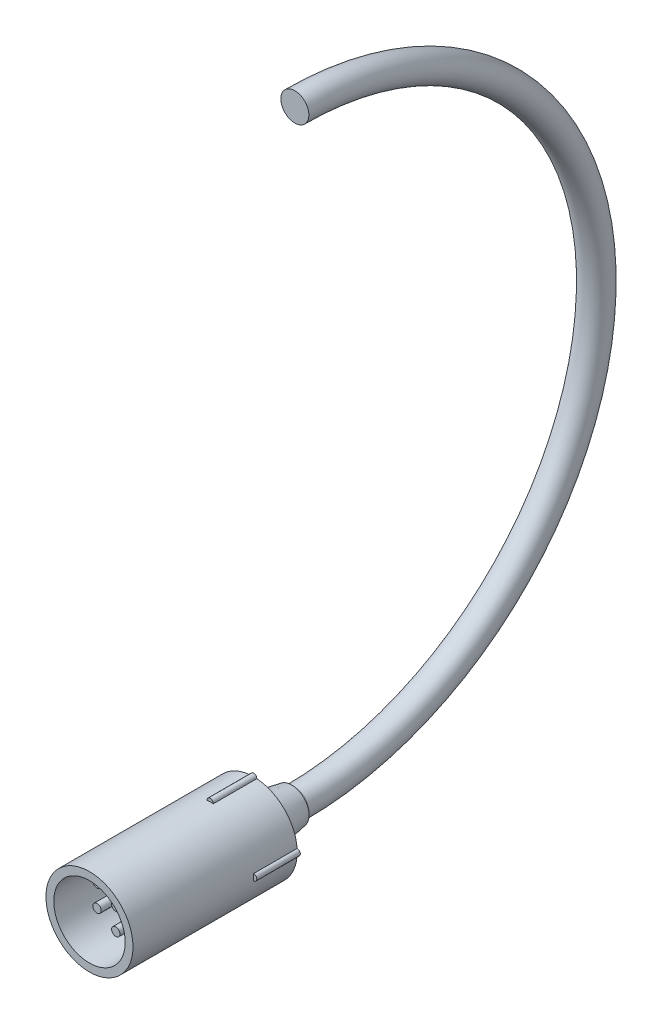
ISO-10303-21;
HEADER;
FILE_DESCRIPTION(('STEP AP214'),'2;1');
FILE_NAME('part.step','',(''),(''),'','','');
FILE_SCHEMA(('AUTOMOTIVE_DESIGN { 1 0 10303 214 1 1 1 1 }'));
ENDSEC;
DATA;
#1=APPLICATION_CONTEXT('core data for automotive mechanical design processes');
#2=APPLICATION_PROTOCOL_DEFINITION('international standard','automotive_design',2000,#1);
#3=PRODUCT_CONTEXT('',#1,'mechanical');
#4=PRODUCT('Part','Part','',(#3));
#5=PRODUCT_RELATED_PRODUCT_CATEGORY('part','',(#4));
#6=PRODUCT_DEFINITION_FORMATION('','',#4);
#7=PRODUCT_DEFINITION_CONTEXT('part definition',#1,'design');
#8=PRODUCT_DEFINITION('design','',#6,#7);
#9=PRODUCT_DEFINITION_SHAPE('','',#8);
#10=(LENGTH_UNIT() NAMED_UNIT(*) SI_UNIT(.MILLI.,.METRE.));
#11=(NAMED_UNIT(*) PLANE_ANGLE_UNIT() SI_UNIT($,.RADIAN.));
#12=(NAMED_UNIT(*) SI_UNIT($,.STERADIAN.) SOLID_ANGLE_UNIT());
#13=UNCERTAINTY_MEASURE_WITH_UNIT(LENGTH_MEASURE(1.E-05),#10,'distance_accuracy_value','');
#14=(GEOMETRIC_REPRESENTATION_CONTEXT(3) GLOBAL_UNCERTAINTY_ASSIGNED_CONTEXT((#13)) GLOBAL_UNIT_ASSIGNED_CONTEXT((#10,
#11,#12)) REPRESENTATION_CONTEXT('',''));
#15=CARTESIAN_POINT('',(0.,0.,0.));
#16=DIRECTION('',(0.,0.,1.));
#17=DIRECTION('',(1.,0.,0.));
#18=AXIS2_PLACEMENT_3D('',#15,#16,#17);
#19=CARTESIAN_POINT('',(0.,0.,0.));
#20=DIRECTION('',(0.,0.,1.));
#21=DIRECTION('',(1.,0.,0.));
#22=AXIS2_PLACEMENT_3D('',#19,#20,#21);
#23=CYLINDRICAL_SURFACE('',#22,6.24891605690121);
#24=CARTESIAN_POINT('',(0.,0.,-20.5599870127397));
#25=DIRECTION('',(0.,0.,1.));
#26=DIRECTION('',(1.,0.,0.));
#27=AXIS2_PLACEMENT_3D('',#24,#25,#26);
#28=CIRCLE('',#27,6.24891605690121);
#29=CARTESIAN_POINT('',(6.24891605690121,0.,-20.5599870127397));
#30=VERTEX_POINT('',#29);
#31=EDGE_CURVE('E142',#30,#30,#28,.T.);
#32=ORIENTED_EDGE('',*,*,#31,.F.);
#33=EDGE_LOOP('',(#32));
#34=FACE_BOUND('',#33,.T.);
#35=CARTESIAN_POINT('',(0.,0.,-19.0568456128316));
#36=DIRECTION('',(0.,0.,1.));
#37=DIRECTION('',(1.,0.,0.));
#38=AXIS2_PLACEMENT_3D('',#35,#36,#37);
#39=CIRCLE('',#38,6.24891605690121);
#40=CARTESIAN_POINT('',(6.24891605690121,0.,-19.0568456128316));
#41=VERTEX_POINT('',#40);
#42=EDGE_CURVE('E12',#41,#41,#39,.T.);
#43=ORIENTED_EDGE('',*,*,#42,.T.);
#44=EDGE_LOOP('',(#43));
#45=FACE_BOUND('',#44,.T.);
#46=ADVANCED_FACE('F52',(#34,#45),#23,.F.);
#47=CARTESIAN_POINT('',(0.,6.24891605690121,-19.0568456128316));
#48=DIRECTION('',(0.,0.,-1.));
#49=DIRECTION('',(-1.,0.,0.));
#50=AXIS2_PLACEMENT_3D('',#47,#48,#49);
#51=PLANE('',#50);
#52=ORIENTED_EDGE('',*,*,#42,.F.);
#53=EDGE_LOOP('',(#52));
#54=FACE_BOUND('',#53,.T.);
#55=CARTESIAN_POINT('',(0.,0.,-19.0568456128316));
#56=DIRECTION('',(0.,0.,1.));
#57=DIRECTION('',(1.,0.,0.));
#58=AXIS2_PLACEMENT_3D('',#55,#56,#57);
#59=CIRCLE('',#58,8.15697436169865);
#60=CARTESIAN_POINT('',(8.15697436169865,0.,-19.0568456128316));
#61=VERTEX_POINT('',#60);
#62=EDGE_CURVE('E60',#61,#61,#59,.T.);
#63=ORIENTED_EDGE('',*,*,#62,.T.);
#64=EDGE_LOOP('',(#63));
#65=FACE_BOUND('',#64,.T.);
#66=ADVANCED_FACE('F240',(#54,#65),#51,.F.);
#67=CARTESIAN_POINT('',(0.,0.,0.));
#68=DIRECTION('',(0.,0.,1.));
#69=DIRECTION('',(1.,0.,0.));
#70=AXIS2_PLACEMENT_3D('',#67,#68,#69);
#71=CYLINDRICAL_SURFACE('',#70,8.15697436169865);
#72=ORIENTED_EDGE('',*,*,#62,.F.);
#73=EDGE_LOOP('',(#72));
#74=FACE_BOUND('',#73,.T.);
#75=CARTESIAN_POINT('',(0.,0.,2.09947416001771));
#76=DIRECTION('',(0.,0.,1.));
#77=DIRECTION('',(1.,0.,0.));
#78=AXIS2_PLACEMENT_3D('',#75,#76,#77);
#79=CIRCLE('',#78,8.15697436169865);
#80=CARTESIAN_POINT('',(8.15697436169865,0.,2.09947416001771));
#81=VERTEX_POINT('',#80);
#82=EDGE_CURVE('E233',#81,#81,#79,.T.);
#83=ORIENTED_EDGE('',*,*,#82,.T.);
#84=EDGE_LOOP('',(#83));
#85=FACE_BOUND('',#84,.T.);
#86=ADVANCED_FACE('F242',(#74,#85),#71,.F.);
#87=CARTESIAN_POINT('',(0.,8.15697436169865,2.09947416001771));
#88=DIRECTION('',(0.,0.,-1.));
#89=DIRECTION('',(-1.,0.,0.));
#90=AXIS2_PLACEMENT_3D('',#87,#88,#89);
#91=PLANE('',#90);
#92=ORIENTED_EDGE('',*,*,#82,.F.);
#93=EDGE_LOOP('',(#92));
#94=FACE_BOUND('',#93,.T.);
#95=CARTESIAN_POINT('',(0.,0.,2.09947416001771));
#96=DIRECTION('',(0.,0.,1.));
#97=DIRECTION('',(1.,0.,0.));
#98=AXIS2_PLACEMENT_3D('',#95,#96,#97);
#99=CIRCLE('',#98,9.02779769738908);
#100=CARTESIAN_POINT('',(9.02779769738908,0.,2.09947416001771));
#101=VERTEX_POINT('',#100);
#102=EDGE_CURVE('E229',#101,#101,#99,.T.);
#103=ORIENTED_EDGE('',*,*,#102,.T.);
#104=EDGE_LOOP('',(#103));
#105=FACE_BOUND('',#104,.T.);
#106=ADVANCED_FACE('F245',(#94,#105),#91,.F.);
#107=CARTESIAN_POINT('',(0.,0.,0.));
#108=DIRECTION('',(0.,0.,1.));
#109=DIRECTION('',(1.,0.,0.));
#110=AXIS2_PLACEMENT_3D('',#107,#108,#109);
#111=CYLINDRICAL_SURFACE('',#110,9.02779769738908);
#112=ORIENTED_EDGE('',*,*,#102,.F.);
#113=EDGE_LOOP('',(#112));
#114=FACE_BOUND('',#113,.T.);
#115=CARTESIAN_POINT('',(0.,0.,20.9400129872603));
#116=DIRECTION('',(0.,0.,1.));
#117=DIRECTION('',(1.,0.,0.));
#118=AXIS2_PLACEMENT_3D('',#115,#116,#117);
#119=CIRCLE('',#118,9.02779769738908);
#120=CARTESIAN_POINT('',(9.02779769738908,0.,20.9400129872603));
#121=VERTEX_POINT('',#120);
#122=EDGE_CURVE('E225',#121,#121,#119,.T.);
#123=ORIENTED_EDGE('',*,*,#122,.T.);
#124=EDGE_LOOP('',(#123));
#125=FACE_BOUND('',#124,.T.);
#126=ADVANCED_FACE('F251',(#114,#125),#111,.F.);
#127=CARTESIAN_POINT('',(0.,9.02779769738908,20.9400129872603));
#128=DIRECTION('',(0.,0.,-1.));
#129=DIRECTION('',(-1.,0.,0.));
#130=AXIS2_PLACEMENT_3D('',#127,#128,#129);
#131=PLANE('',#130);
#132=ORIENTED_EDGE('',*,*,#122,.F.);
#133=EDGE_LOOP('',(#132));
#134=FACE_BOUND('',#133,.T.);
#135=CARTESIAN_POINT('',(0.,0.,20.9400129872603));
#136=DIRECTION('',(0.,0.,1.));
#137=DIRECTION('',(1.,0.,0.));
#138=AXIS2_PLACEMENT_3D('',#135,#136,#137);
#139=CIRCLE('',#138,11.);
#140=CARTESIAN_POINT('',(11.,0.,20.9400129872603));
#141=VERTEX_POINT('',#140);
#142=EDGE_CURVE('E220',#141,#141,#139,.T.);
#143=ORIENTED_EDGE('',*,*,#142,.T.);
#144=EDGE_LOOP('',(#143));
#145=FACE_BOUND('',#144,.T.);
#146=ADVANCED_FACE('F257',(#134,#145),#131,.F.);
#147=CARTESIAN_POINT('',(0.,0.,0.));
#148=DIRECTION('',(0.,0.,1.));
#149=DIRECTION('',(1.,0.,0.));
#150=AXIS2_PLACEMENT_3D('',#147,#148,#149);
#151=CYLINDRICAL_SURFACE('',#150,11.);
#152=ORIENTED_EDGE('',*,*,#142,.F.);
#153=EDGE_LOOP('',(#152));
#154=FACE_BOUND('',#153,.T.);
#155=CARTESIAN_POINT('',(0.,0.,-9.55998701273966));
#156=DIRECTION('',(0.,0.,1.));
#157=DIRECTION('',(0.,1.,0.));
#158=AXIS2_PLACEMENT_3D('',#155,#156,#157);
#159=CIRCLE('',#158,11.);
#160=CARTESIAN_POINT('',(10.9717894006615,-0.787297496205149,-9.55998701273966));
#161=VERTEX_POINT('',#160);
#162=CARTESIAN_POINT('',(10.9717894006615,0.787297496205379,-9.55998701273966));
#163=VERTEX_POINT('',#162);
#164=EDGE_CURVE('E74',#161,#163,#159,.T.);
#165=ORIENTED_EDGE('',*,*,#164,.T.);
#166=DIRECTION('',(0.,0.,-1.));
#167=VECTOR('',#166,1.);
#168=CARTESIAN_POINT('',(10.9717894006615,0.787297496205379,-9.55998701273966));
#169=LINE('',#168,#167);
#170=CARTESIAN_POINT('',(10.9717894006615,0.787297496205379,-20.5599870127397));
#171=VERTEX_POINT('',#170);
#172=EDGE_CURVE('E145',#163,#171,#169,.T.);
#173=ORIENTED_EDGE('',*,*,#172,.T.);
#174=CARTESIAN_POINT('',(0.,0.,-20.5599870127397));
#175=DIRECTION('',(0.,0.,1.));
#176=DIRECTION('',(1.,0.,0.));
#177=AXIS2_PLACEMENT_3D('',#174,#175,#176);
#178=CIRCLE('',#177,11.);
#179=CARTESIAN_POINT('',(0.787297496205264,10.9717894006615,-20.5599870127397));
#180=VERTEX_POINT('',#179);
#181=EDGE_CURVE('E132',#171,#180,#178,.T.);
#182=ORIENTED_EDGE('',*,*,#181,.T.);
#183=DIRECTION('',(0.,0.,-1.));
#184=VECTOR('',#183,1.);
#185=CARTESIAN_POINT('',(0.787297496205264,10.9717894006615,-9.55998701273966));
#186=LINE('',#185,#184);
#187=CARTESIAN_POINT('',(0.787297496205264,10.9717894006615,-9.55998701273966));
#188=VERTEX_POINT('',#187);
#189=EDGE_CURVE('E210',#188,#180,#186,.T.);
#190=ORIENTED_EDGE('',*,*,#189,.F.);
#191=CARTESIAN_POINT('',(0.,0.,-9.55998701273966));
#192=DIRECTION('',(0.,0.,1.));
#193=DIRECTION('',(-1.,0.,0.));
#194=AXIS2_PLACEMENT_3D('',#191,#192,#193);
#195=CIRCLE('',#194,11.);
#196=CARTESIAN_POINT('',(-0.787297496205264,10.9717894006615,-9.55998701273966));
#197=VERTEX_POINT('',#196);
#198=EDGE_CURVE('E200',#188,#197,#195,.T.);
#199=ORIENTED_EDGE('',*,*,#198,.T.);
#200=DIRECTION('',(0.,0.,-1.));
#201=VECTOR('',#200,1.);
#202=CARTESIAN_POINT('',(-0.787297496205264,10.9717894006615,-9.55998701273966));
#203=LINE('',#202,#201);
#204=CARTESIAN_POINT('',(-0.787297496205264,10.9717894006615,-20.5599870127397));
#205=VERTEX_POINT('',#204);
#206=EDGE_CURVE('E207',#197,#205,#203,.T.);
#207=ORIENTED_EDGE('',*,*,#206,.T.);
#208=CARTESIAN_POINT('',(-10.9717894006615,0.787297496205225,-20.5599870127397));
#209=VERTEX_POINT('',#208);
#210=EDGE_CURVE('E144',#205,#209,#178,.T.);
#211=ORIENTED_EDGE('',*,*,#210,.T.);
#212=DIRECTION('',(0.,0.,-1.));
#213=VECTOR('',#212,1.);
#214=CARTESIAN_POINT('',(-10.9717894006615,0.787297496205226,-9.55998701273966));
#215=LINE('',#214,#213);
#216=CARTESIAN_POINT('',(-10.9717894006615,0.787297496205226,-9.55998701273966));
#217=VERTEX_POINT('',#216);
#218=EDGE_CURVE('E193',#217,#209,#215,.T.);
#219=ORIENTED_EDGE('',*,*,#218,.F.);
#220=CARTESIAN_POINT('',(0.,0.,-9.55998701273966));
#221=DIRECTION('',(0.,0.,1.));
#222=DIRECTION('',(0.,-1.,0.));
#223=AXIS2_PLACEMENT_3D('',#220,#221,#222);
#224=CIRCLE('',#223,11.);
#225=CARTESIAN_POINT('',(-10.9717894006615,-0.787297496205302,-9.55998701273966));
#226=VERTEX_POINT('',#225);
#227=EDGE_CURVE('E183',#217,#226,#224,.T.);
#228=ORIENTED_EDGE('',*,*,#227,.T.);
#229=DIRECTION('',(0.,0.,-1.));
#230=VECTOR('',#229,1.);
#231=CARTESIAN_POINT('',(-10.9717894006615,-0.787297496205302,-9.55998701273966));
#232=LINE('',#231,#230);
#233=CARTESIAN_POINT('',(-10.9717894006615,-0.787297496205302,-20.5599870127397));
#234=VERTEX_POINT('',#233);
#235=EDGE_CURVE('E189',#226,#234,#232,.T.);
#236=ORIENTED_EDGE('',*,*,#235,.T.);
#237=CARTESIAN_POINT('',(-0.787297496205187,-10.9717894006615,-20.5599870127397));
#238=VERTEX_POINT('',#237);
#239=EDGE_CURVE('E221',#234,#238,#178,.T.);
#240=ORIENTED_EDGE('',*,*,#239,.T.);
#241=DIRECTION('',(0.,0.,-1.));
#242=VECTOR('',#241,1.);
#243=CARTESIAN_POINT('',(-0.787297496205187,-10.9717894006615,-9.55998701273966));
#244=LINE('',#243,#242);
#245=CARTESIAN_POINT('',(-0.787297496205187,-10.9717894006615,-9.55998701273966));
#246=VERTEX_POINT('',#245);
#247=EDGE_CURVE('E175',#246,#238,#244,.T.);
#248=ORIENTED_EDGE('',*,*,#247,.F.);
#249=CARTESIAN_POINT('',(0.,0.,-9.55998701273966));
#250=DIRECTION('',(0.,0.,1.));
#251=DIRECTION('',(1.,0.,0.));
#252=AXIS2_PLACEMENT_3D('',#249,#250,#251);
#253=CIRCLE('',#252,11.);
#254=CARTESIAN_POINT('',(0.787297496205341,-10.9717894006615,-9.55998701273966));
#255=VERTEX_POINT('',#254);
#256=EDGE_CURVE('E164',#246,#255,#253,.T.);
#257=ORIENTED_EDGE('',*,*,#256,.T.);
#258=DIRECTION('',(0.,0.,-1.));
#259=VECTOR('',#258,1.);
#260=CARTESIAN_POINT('',(0.787297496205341,-10.9717894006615,-9.55998701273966));
#261=LINE('',#260,#259);
#262=CARTESIAN_POINT('',(0.787297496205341,-10.9717894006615,-20.5599870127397));
#263=VERTEX_POINT('',#262);
#264=EDGE_CURVE('E171',#255,#263,#261,.T.);
#265=ORIENTED_EDGE('',*,*,#264,.T.);
#266=CARTESIAN_POINT('',(10.9717894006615,-0.787297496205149,-20.5599870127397));
#267=VERTEX_POINT('',#266);
#268=EDGE_CURVE('E141',#263,#267,#178,.T.);
#269=ORIENTED_EDGE('',*,*,#268,.T.);
#270=DIRECTION('',(0.,0.,-1.));
#271=VECTOR('',#270,1.);
#272=CARTESIAN_POINT('',(10.9717894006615,-0.787297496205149,-9.55998701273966));
#273=LINE('',#272,#271);
#274=EDGE_CURVE('E70',#161,#267,#273,.T.);
#275=ORIENTED_EDGE('',*,*,#274,.F.);
#276=EDGE_LOOP('',(#165,#173,#182,#190,#199,#207,#211,#219,#228,#236,#240,#248,#257,#265,#269,#275));
#277=FACE_BOUND('',#276,.T.);
#278=ADVANCED_FACE('F146',(#154,#277),#151,.T.);
#279=CARTESIAN_POINT('',(0.,11.,-20.5599870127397));
#280=DIRECTION('',(0.,0.,1.));
#281=DIRECTION('',(1.,0.,0.));
#282=AXIS2_PLACEMENT_3D('',#279,#280,#281);
#283=PLANE('',#282);
#284=ORIENTED_EDGE('',*,*,#210,.F.);
#285=CARTESIAN_POINT('',(0.,11.,-20.5599870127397));
#286=DIRECTION('',(0.,0.,-1.));
#287=DIRECTION('',(-1.,0.,0.));
#288=AXIS2_PLACEMENT_3D('',#285,#286,#287);
#289=CIRCLE('',#288,0.787802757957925);
#290=EDGE_CURVE('E138',#205,#180,#289,.T.);
#291=ORIENTED_EDGE('',*,*,#290,.T.);
#292=ORIENTED_EDGE('',*,*,#181,.F.);
#293=CARTESIAN_POINT('',(11.,1.1521895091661E-13,-20.5599870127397));
#294=DIRECTION('',(0.,0.,-1.));
#295=DIRECTION('',(0.,1.,0.));
#296=AXIS2_PLACEMENT_3D('',#293,#294,#295);
#297=CIRCLE('',#296,0.787802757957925);
#298=EDGE_CURVE('E136',#171,#267,#297,.T.);
#299=ORIENTED_EDGE('',*,*,#298,.T.);
#300=ORIENTED_EDGE('',*,*,#268,.F.);
#301=CARTESIAN_POINT('',(0.,-11.,-20.5599870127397));
#302=DIRECTION('',(0.,0.,-1.));
#303=DIRECTION('',(1.,0.,0.));
#304=AXIS2_PLACEMENT_3D('',#301,#302,#303);
#305=CIRCLE('',#304,0.787802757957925);
#306=EDGE_CURVE('E162',#263,#238,#305,.T.);
#307=ORIENTED_EDGE('',*,*,#306,.T.);
#308=ORIENTED_EDGE('',*,*,#239,.F.);
#309=CARTESIAN_POINT('',(-11.,0.,-20.5599870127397));
#310=DIRECTION('',(0.,0.,-1.));
#311=DIRECTION('',(0.,-1.,0.));
#312=AXIS2_PLACEMENT_3D('',#309,#310,#311);
#313=CIRCLE('',#312,0.787802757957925);
#314=EDGE_CURVE('E179',#234,#209,#313,.T.);
#315=ORIENTED_EDGE('',*,*,#314,.T.);
#316=EDGE_LOOP('',(#284,#291,#292,#299,#300,#307,#308,#315));
#317=FACE_BOUND('',#316,.T.);
#318=ORIENTED_EDGE('',*,*,#31,.T.);
#319=EDGE_LOOP('',(#318));
#320=FACE_BOUND('',#319,.T.);
#321=ADVANCED_FACE('F133',(#317,#320),#283,.F.);
#322=CARTESIAN_POINT('',(0.,11.,-9.55998701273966));
#323=DIRECTION('',(0.,0.,-1.));
#324=DIRECTION('',(-1.,0.,0.));
#325=AXIS2_PLACEMENT_3D('',#322,#323,#324);
#326=CYLINDRICAL_SURFACE('',#325,0.787802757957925);
#327=ORIENTED_EDGE('',*,*,#290,.F.);
#328=ORIENTED_EDGE('',*,*,#206,.F.);
#329=CARTESIAN_POINT('',(0.,11.,-9.55998701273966));
#330=DIRECTION('',(0.,0.,-1.));
#331=DIRECTION('',(-1.,0.,0.));
#332=AXIS2_PLACEMENT_3D('',#329,#330,#331);
#333=CIRCLE('',#332,0.787802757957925);
#334=EDGE_CURVE('E203',#197,#188,#333,.T.);
#335=ORIENTED_EDGE('',*,*,#334,.T.);
#336=ORIENTED_EDGE('',*,*,#189,.T.);
#337=EDGE_LOOP('',(#327,#328,#335,#336));
#338=FACE_BOUND('',#337,.T.);
#339=ADVANCED_FACE('F271',(#338),#326,.T.);
#340=CARTESIAN_POINT('',(0.,5.5,-9.55998701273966));
#341=DIRECTION('',(0.,0.,-1.));
#342=DIRECTION('',(-1.,0.,0.));
#343=AXIS2_PLACEMENT_3D('',#340,#341,#342);
#344=PLANE('',#343);
#345=ORIENTED_EDGE('',*,*,#198,.F.);
#346=ORIENTED_EDGE('',*,*,#334,.F.);
#347=EDGE_LOOP('',(#345,#346));
#348=FACE_BOUND('',#347,.T.);
#349=ADVANCED_FACE('F309',(#348),#344,.F.);
#350=CARTESIAN_POINT('',(-11.,0.,-9.55998701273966));
#351=DIRECTION('',(0.,0.,-1.));
#352=DIRECTION('',(-1.,0.,0.));
#353=AXIS2_PLACEMENT_3D('',#350,#351,#352);
#354=CYLINDRICAL_SURFACE('',#353,0.787802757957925);
#355=ORIENTED_EDGE('',*,*,#314,.F.);
#356=ORIENTED_EDGE('',*,*,#235,.F.);
#357=CARTESIAN_POINT('',(-11.,0.,-9.55998701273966));
#358=DIRECTION('',(0.,0.,-1.));
#359=DIRECTION('',(0.,-1.,0.));
#360=AXIS2_PLACEMENT_3D('',#357,#358,#359);
#361=CIRCLE('',#360,0.787802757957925);
#362=EDGE_CURVE('E186',#226,#217,#361,.T.);
#363=ORIENTED_EDGE('',*,*,#362,.T.);
#364=ORIENTED_EDGE('',*,*,#218,.T.);
#365=EDGE_LOOP('',(#355,#356,#363,#364));
#366=FACE_BOUND('',#365,.T.);
#367=ADVANCED_FACE('F320',(#366),#354,.T.);
#368=CARTESIAN_POINT('',(-5.5,0.,-9.55998701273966));
#369=DIRECTION('',(0.,0.,-1.));
#370=DIRECTION('',(0.,-1.,0.));
#371=AXIS2_PLACEMENT_3D('',#368,#369,#370);
#372=PLANE('',#371);
#373=ORIENTED_EDGE('',*,*,#227,.F.);
#374=ORIENTED_EDGE('',*,*,#362,.F.);
#375=EDGE_LOOP('',(#373,#374));
#376=FACE_BOUND('',#375,.T.);
#377=ADVANCED_FACE('F342',(#376),#372,.F.);
#378=CARTESIAN_POINT('',(0.,-11.,-9.55998701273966));
#379=DIRECTION('',(0.,0.,-1.));
#380=DIRECTION('',(-1.,0.,0.));
#381=AXIS2_PLACEMENT_3D('',#378,#379,#380);
#382=CYLINDRICAL_SURFACE('',#381,0.787802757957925);
#383=ORIENTED_EDGE('',*,*,#306,.F.);
#384=ORIENTED_EDGE('',*,*,#264,.F.);
#385=CARTESIAN_POINT('',(0.,-11.,-9.55998701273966));
#386=DIRECTION('',(0.,0.,-1.));
#387=DIRECTION('',(1.,0.,0.));
#388=AXIS2_PLACEMENT_3D('',#385,#386,#387);
#389=CIRCLE('',#388,0.787802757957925);
#390=EDGE_CURVE('E167',#255,#246,#389,.T.);
#391=ORIENTED_EDGE('',*,*,#390,.T.);
#392=ORIENTED_EDGE('',*,*,#247,.T.);
#393=EDGE_LOOP('',(#383,#384,#391,#392));
#394=FACE_BOUND('',#393,.T.);
#395=ADVANCED_FACE('F355',(#394),#382,.T.);
#396=CARTESIAN_POINT('',(0.,-5.5,-9.55998701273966));
#397=DIRECTION('',(0.,0.,-1.));
#398=DIRECTION('',(1.,0.,0.));
#399=AXIS2_PLACEMENT_3D('',#396,#397,#398);
#400=PLANE('',#399);
#401=ORIENTED_EDGE('',*,*,#256,.F.);
#402=ORIENTED_EDGE('',*,*,#390,.F.);
#403=EDGE_LOOP('',(#401,#402));
#404=FACE_BOUND('',#403,.T.);
#405=ADVANCED_FACE('F366',(#404),#400,.F.);
#406=CARTESIAN_POINT('',(11.,1.1521895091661E-13,-9.55998701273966));
#407=DIRECTION('',(0.,0.,-1.));
#408=DIRECTION('',(-1.,0.,0.));
#409=AXIS2_PLACEMENT_3D('',#406,#407,#408);
#410=CYLINDRICAL_SURFACE('',#409,0.787802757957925);
#411=ORIENTED_EDGE('',*,*,#298,.F.);
#412=ORIENTED_EDGE('',*,*,#172,.F.);
#413=CARTESIAN_POINT('',(11.,1.1521895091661E-13,-9.55998701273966));
#414=DIRECTION('',(0.,0.,-1.));
#415=DIRECTION('',(0.,1.,0.));
#416=AXIS2_PLACEMENT_3D('',#413,#414,#415);
#417=CIRCLE('',#416,0.787802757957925);
#418=EDGE_CURVE('E151',#163,#161,#417,.T.);
#419=ORIENTED_EDGE('',*,*,#418,.T.);
#420=ORIENTED_EDGE('',*,*,#274,.T.);
#421=EDGE_LOOP('',(#411,#412,#419,#420));
#422=FACE_BOUND('',#421,.T.);
#423=ADVANCED_FACE('F153',(#422),#410,.T.);
#424=CARTESIAN_POINT('',(5.5,0.,-9.55998701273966));
#425=DIRECTION('',(0.,0.,-1.));
#426=DIRECTION('',(0.,1.,0.));
#427=AXIS2_PLACEMENT_3D('',#424,#425,#426);
#428=PLANE('',#427);
#429=ORIENTED_EDGE('',*,*,#164,.F.);
#430=ORIENTED_EDGE('',*,*,#418,.F.);
#431=EDGE_LOOP('',(#429,#430));
#432=FACE_BOUND('',#431,.T.);
#433=ADVANCED_FACE('F386',(#432),#428,.F.);
#434=CLOSED_SHELL('',(#46,#66,#86,#106,#126,#146,#278,#321,#339,#349,#367,#377,#395,#405,#423,#433));
#435=MANIFOLD_SOLID_BREP('B2',#434);
#436=CARTESIAN_POINT('',(0.,0.,-30.1625));
#437=DIRECTION('',(0.,0.,-1.));
#438=DIRECTION('',(-1.,0.,0.));
#439=AXIS2_PLACEMENT_3D('',#436,#437,#438);
#440=PLANE('',#439);
#441=CARTESIAN_POINT('',(0.,0.,-30.1625));
#442=DIRECTION('',(0.,0.,-1.));
#443=DIRECTION('',(-1.,0.,0.));
#444=AXIS2_PLACEMENT_3D('',#441,#442,#443);
#445=CIRCLE('',#444,4.39337397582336);
#446=CARTESIAN_POINT('',(-4.39337397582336,0.,-30.1625));
#447=VERTEX_POINT('',#446);
#448=EDGE_CURVE('E556',#447,#447,#445,.T.);
#449=ORIENTED_EDGE('',*,*,#448,.T.);
#450=EDGE_LOOP('',(#449));
#451=FACE_BOUND('',#450,.T.);
#452=CARTESIAN_POINT('',(0.,0.,-30.1625));
#453=DIRECTION('',(0.,0.,-1.));
#454=DIRECTION('',(-1.,0.,0.));
#455=AXIS2_PLACEMENT_3D('',#452,#453,#454);
#456=CIRCLE('',#455,3.5433);
#457=CARTESIAN_POINT('',(-3.5433,0.,-30.1625));
#458=VERTEX_POINT('',#457);
#459=EDGE_CURVE('E561',#458,#458,#456,.T.);
#460=ORIENTED_EDGE('',*,*,#459,.F.);
#461=EDGE_LOOP('',(#460));
#462=FACE_BOUND('',#461,.T.);
#463=ADVANCED_FACE('F439',(#451,#462),#440,.T.);
#464=CARTESIAN_POINT('',(0.,0.,-19.05));
#465=DIRECTION('',(0.,0.,1.));
#466=DIRECTION('',(1.,0.,0.));
#467=AXIS2_PLACEMENT_3D('',#464,#465,#466);
#468=PLANE('',#467);
#469=CARTESIAN_POINT('',(0.,0.,-19.05));
#470=DIRECTION('',(0.,0.,1.));
#471=DIRECTION('',(1.,0.,0.));
#472=AXIS2_PLACEMENT_3D('',#469,#470,#471);
#473=CIRCLE('',#472,7.747);
#474=CARTESIAN_POINT('',(7.747,0.,-19.05));
#475=VERTEX_POINT('',#474);
#476=EDGE_CURVE('E447',#475,#475,#473,.T.);
#477=ORIENTED_EDGE('',*,*,#476,.F.);
#478=EDGE_LOOP('',(#477));
#479=FACE_BOUND('',#478,.T.);
#480=CARTESIAN_POINT('',(0.,0.,-19.05));
#481=DIRECTION('',(0.,0.,1.));
#482=DIRECTION('',(1.,0.,0.));
#483=AXIS2_PLACEMENT_3D('',#480,#481,#482);
#484=CIRCLE('',#483,6.35280754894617);
#485=CARTESIAN_POINT('',(6.35280754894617,0.,-19.05));
#486=VERTEX_POINT('',#485);
#487=EDGE_CURVE('E51',#486,#486,#484,.F.);
#488=ORIENTED_EDGE('',*,*,#487,.F.);
#489=EDGE_LOOP('',(#488));
#490=FACE_BOUND('',#489,.T.);
#491=ADVANCED_FACE('F587',(#479,#490),#468,.F.);
#492=CARTESIAN_POINT('',(0.,-5.48467968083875,9.525));
#493=DIRECTION('',(0.,0.,1.));
#494=DIRECTION('',(1.,0.,0.));
#495=AXIS2_PLACEMENT_3D('',#492,#493,#494);
#496=PLANE('',#495);
#497=CARTESIAN_POINT('',(0.,0.,9.525));
#498=DIRECTION('',(0.,0.,1.));
#499=DIRECTION('',(1.,0.,0.));
#500=AXIS2_PLACEMENT_3D('',#497,#498,#499);
#501=CIRCLE('',#500,1.44069993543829);
#502=CARTESIAN_POINT('',(-1.44069993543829,0.,9.525));
#503=VERTEX_POINT('',#502);
#504=EDGE_CURVE('E537',#503,#503,#501,.T.);
#505=ORIENTED_EDGE('',*,*,#504,.T.);
#506=EDGE_LOOP('',(#505));
#507=FACE_BOUND('',#506,.T.);
#508=CARTESIAN_POINT('',(0.,0.,9.525));
#509=DIRECTION('',(0.,0.,1.));
#510=DIRECTION('',(1.,0.,0.));
#511=AXIS2_PLACEMENT_3D('',#508,#509,#510);
#512=CIRCLE('',#511,1.06856203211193);
#513=CARTESIAN_POINT('',(1.06856203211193,0.,9.525));
#514=VERTEX_POINT('',#513);
#515=EDGE_CURVE('E552',#514,#514,#512,.T.);
#516=ORIENTED_EDGE('',*,*,#515,.F.);
#517=EDGE_LOOP('',(#516));
#518=FACE_BOUND('',#517,.T.);
#519=ADVANCED_FACE('F593',(#507,#518),#496,.T.);
#520=CARTESIAN_POINT('',(0.,0.,0.));
#521=DIRECTION('',(0.,0.,1.));
#522=DIRECTION('',(1.,0.,0.));
#523=AXIS2_PLACEMENT_3D('',#520,#521,#522);
#524=PLANE('',#523);
#525=CARTESIAN_POINT('',(-4.74987193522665,-2.74233984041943,0.));
#526=DIRECTION('',(0.,0.,1.));
#527=DIRECTION('',(0.50000000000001,-0.866025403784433,0.));
#528=AXIS2_PLACEMENT_3D('',#525,#526,#527);
#529=CIRCLE('',#528,1.38195304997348);
#530=CARTESIAN_POINT('',(-4.0588954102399,-3.93914628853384,0.));
#531=VERTEX_POINT('',#530);
#532=EDGE_CURVE('E502',#531,#531,#529,.T.);
#533=ORIENTED_EDGE('',*,*,#532,.F.);
#534=EDGE_LOOP('',(#533));
#535=FACE_BOUND('',#534,.T.);
#536=CARTESIAN_POINT('',(4.74987193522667,2.7423398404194,0.));
#537=DIRECTION('',(0.,0.,1.));
#538=DIRECTION('',(-0.500000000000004,0.866025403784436,0.));
#539=AXIS2_PLACEMENT_3D('',#536,#537,#538);
#540=CIRCLE('',#539,1.38195304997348);
#541=CARTESIAN_POINT('',(4.05889541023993,3.93914628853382,0.));
#542=VERTEX_POINT('',#541);
#543=EDGE_CURVE('E486',#542,#542,#540,.T.);
#544=ORIENTED_EDGE('',*,*,#543,.F.);
#545=EDGE_LOOP('',(#544));
#546=FACE_BOUND('',#545,.T.);
#547=CARTESIAN_POINT('',(0.,-5.48467968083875,0.));
#548=DIRECTION('',(0.,0.,1.));
#549=DIRECTION('',(1.,0.,0.));
#550=AXIS2_PLACEMENT_3D('',#547,#548,#549);
#551=CIRCLE('',#550,1.38195304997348);
#552=CARTESIAN_POINT('',(1.38195304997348,-5.48467968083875,0.));
#553=VERTEX_POINT('',#552);
#554=EDGE_CURVE('E462',#553,#553,#551,.T.);
#555=ORIENTED_EDGE('',*,*,#554,.F.);
#556=EDGE_LOOP('',(#555));
#557=FACE_BOUND('',#556,.T.);
#558=CARTESIAN_POINT('',(0.,0.,0.));
#559=DIRECTION('',(0.,0.,1.));
#560=DIRECTION('',(1.,0.,0.));
#561=AXIS2_PLACEMENT_3D('',#558,#559,#560);
#562=CIRCLE('',#561,7.747);
#563=CARTESIAN_POINT('',(7.747,0.,0.));
#564=VERTEX_POINT('',#563);
#565=EDGE_CURVE('E453',#564,#564,#562,.T.);
#566=ORIENTED_EDGE('',*,*,#565,.T.);
#567=EDGE_LOOP('',(#566));
#568=FACE_BOUND('',#567,.T.);
#569=CARTESIAN_POINT('',(4.74987193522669,-2.74233984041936,0.));
#570=DIRECTION('',(0.,0.,1.));
#571=DIRECTION('',(0.499999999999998,0.86602540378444,0.));
#572=AXIS2_PLACEMENT_3D('',#569,#570,#571);
#573=CIRCLE('',#572,1.38195304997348);
#574=CARTESIAN_POINT('',(5.44084846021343,-1.54553339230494,0.));
#575=VERTEX_POINT('',#574);
#576=EDGE_CURVE('E478',#575,#575,#573,.T.);
#577=ORIENTED_EDGE('',*,*,#576,.F.);
#578=EDGE_LOOP('',(#577));
#579=FACE_BOUND('',#578,.T.);
#580=CARTESIAN_POINT('',(-4.74987193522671,2.74233984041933,0.));
#581=DIRECTION('',(0.,0.,1.));
#582=DIRECTION('',(-0.499999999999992,-0.866025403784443,0.));
#583=AXIS2_PLACEMENT_3D('',#580,#581,#582);
#584=CIRCLE('',#583,1.38195304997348);
#585=CARTESIAN_POINT('',(-5.44084846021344,1.54553339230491,0.));
#586=VERTEX_POINT('',#585);
#587=EDGE_CURVE('E494',#586,#586,#584,.T.);
#588=ORIENTED_EDGE('',*,*,#587,.F.);
#589=EDGE_LOOP('',(#588));
#590=FACE_BOUND('',#589,.T.);
#591=CARTESIAN_POINT('',(0.,0.,0.));
#592=DIRECTION('',(0.,0.,1.));
#593=DIRECTION('',(1.,0.,0.));
#594=AXIS2_PLACEMENT_3D('',#591,#592,#593);
#595=CIRCLE('',#594,1.44069993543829);
#596=CARTESIAN_POINT('',(-1.44069993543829,0.,0.));
#597=VERTEX_POINT('',#596);
#598=EDGE_CURVE('E544',#597,#597,#595,.T.);
#599=ORIENTED_EDGE('',*,*,#598,.F.);
#600=EDGE_LOOP('',(#599));
#601=FACE_BOUND('',#600,.T.);
#602=ADVANCED_FACE('F615',(#535,#546,#557,#568,#579,#590,#601),#524,.T.);
#603=CARTESIAN_POINT('',(-4.74987193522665,-2.74233984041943,9.525));
#604=DIRECTION('',(0.,0.,1.));
#605=DIRECTION('',(0.50000000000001,-0.866025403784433,0.));
#606=AXIS2_PLACEMENT_3D('',#603,#604,#605);
#607=PLANE('',#606);
#608=CARTESIAN_POINT('',(-4.74987193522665,-2.74233984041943,9.525));
#609=DIRECTION('',(0.,0.,1.));
#610=DIRECTION('',(0.50000000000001,-0.866025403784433,0.));
#611=AXIS2_PLACEMENT_3D('',#608,#609,#610);
#612=CIRCLE('',#611,1.38195304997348);
#613=CARTESIAN_POINT('',(-4.0588954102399,-3.93914628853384,9.525));
#614=VERTEX_POINT('',#613);
#615=EDGE_CURVE('E498',#614,#614,#612,.T.);
#616=ORIENTED_EDGE('',*,*,#615,.T.);
#617=EDGE_LOOP('',(#616));
#618=FACE_BOUND('',#617,.T.);
#619=CARTESIAN_POINT('',(-4.74987193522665,-2.74233984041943,9.525));
#620=DIRECTION('',(0.,0.,1.));
#621=DIRECTION('',(0.50000000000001,-0.866025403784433,0.));
#622=AXIS2_PLACEMENT_3D('',#619,#620,#621);
#623=CIRCLE('',#622,1.06048512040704);
#624=CARTESIAN_POINT('',(-4.21962937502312,-3.66074689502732,9.525));
#625=VERTEX_POINT('',#624);
#626=EDGE_CURVE('E533',#625,#625,#623,.T.);
#627=ORIENTED_EDGE('',*,*,#626,.F.);
#628=EDGE_LOOP('',(#627));
#629=FACE_BOUND('',#628,.T.);
#630=ADVANCED_FACE('F649',(#618,#629),#607,.T.);
#631=CARTESIAN_POINT('',(-4.74987193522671,2.74233984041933,9.525));
#632=DIRECTION('',(0.,0.,1.));
#633=DIRECTION('',(-0.499999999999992,-0.866025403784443,0.));
#634=AXIS2_PLACEMENT_3D('',#631,#632,#633);
#635=PLANE('',#634);
#636=CARTESIAN_POINT('',(-4.74987193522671,2.74233984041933,9.525));
#637=DIRECTION('',(0.,0.,1.));
#638=DIRECTION('',(-0.499999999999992,-0.866025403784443,0.));
#639=AXIS2_PLACEMENT_3D('',#636,#637,#638);
#640=CIRCLE('',#639,1.38195304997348);
#641=CARTESIAN_POINT('',(-5.44084846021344,1.54553339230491,9.525));
#642=VERTEX_POINT('',#641);
#643=EDGE_CURVE('E490',#642,#642,#640,.T.);
#644=ORIENTED_EDGE('',*,*,#643,.T.);
#645=EDGE_LOOP('',(#644));
#646=FACE_BOUND('',#645,.T.);
#647=CARTESIAN_POINT('',(-4.74987193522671,2.74233984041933,9.525));
#648=DIRECTION('',(0.,0.,1.));
#649=DIRECTION('',(-0.499999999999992,-0.866025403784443,0.));
#650=AXIS2_PLACEMENT_3D('',#647,#648,#649);
#651=CIRCLE('',#650,1.06048512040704);
#652=CARTESIAN_POINT('',(-5.28011449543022,1.82393278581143,9.525));
#653=VERTEX_POINT('',#652);
#654=EDGE_CURVE('E525',#653,#653,#651,.T.);
#655=ORIENTED_EDGE('',*,*,#654,.F.);
#656=EDGE_LOOP('',(#655));
#657=FACE_BOUND('',#656,.T.);
#658=ADVANCED_FACE('F652',(#646,#657),#635,.T.);
#659=CARTESIAN_POINT('',(4.74987193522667,2.7423398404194,9.525));
#660=DIRECTION('',(0.,0.,1.));
#661=DIRECTION('',(-0.500000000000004,0.866025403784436,0.));
#662=AXIS2_PLACEMENT_3D('',#659,#660,#661);
#663=PLANE('',#662);
#664=CARTESIAN_POINT('',(4.74987193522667,2.7423398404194,9.525));
#665=DIRECTION('',(0.,0.,1.));
#666=DIRECTION('',(-0.500000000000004,0.866025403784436,0.));
#667=AXIS2_PLACEMENT_3D('',#664,#665,#666);
#668=CIRCLE('',#667,1.38195304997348);
#669=CARTESIAN_POINT('',(4.05889541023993,3.93914628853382,9.525));
#670=VERTEX_POINT('',#669);
#671=EDGE_CURVE('E482',#670,#670,#668,.T.);
#672=ORIENTED_EDGE('',*,*,#671,.T.);
#673=EDGE_LOOP('',(#672));
#674=FACE_BOUND('',#673,.T.);
#675=CARTESIAN_POINT('',(4.74987193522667,2.7423398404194,9.525));
#676=DIRECTION('',(0.,0.,1.));
#677=DIRECTION('',(-0.500000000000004,0.866025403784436,0.));
#678=AXIS2_PLACEMENT_3D('',#675,#676,#677);
#679=CIRCLE('',#678,1.06048512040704);
#680=CARTESIAN_POINT('',(4.21962937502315,3.66074689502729,9.525));
#681=VERTEX_POINT('',#680);
#682=EDGE_CURVE('E517',#681,#681,#679,.T.);
#683=ORIENTED_EDGE('',*,*,#682,.F.);
#684=EDGE_LOOP('',(#683));
#685=FACE_BOUND('',#684,.T.);
#686=ADVANCED_FACE('F660',(#674,#685),#663,.T.);
#687=CARTESIAN_POINT('',(4.74987193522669,-2.74233984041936,9.525));
#688=DIRECTION('',(0.,0.,1.));
#689=DIRECTION('',(0.499999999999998,0.86602540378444,0.));
#690=AXIS2_PLACEMENT_3D('',#687,#688,#689);
#691=PLANE('',#690);
#692=CARTESIAN_POINT('',(4.74987193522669,-2.74233984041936,9.525));
#693=DIRECTION('',(0.,0.,1.));
#694=DIRECTION('',(0.499999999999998,0.86602540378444,0.));
#695=AXIS2_PLACEMENT_3D('',#692,#693,#694);
#696=CIRCLE('',#695,1.38195304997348);
#697=CARTESIAN_POINT('',(5.44084846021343,-1.54553339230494,9.525));
#698=VERTEX_POINT('',#697);
#699=EDGE_CURVE('E474',#698,#698,#696,.T.);
#700=ORIENTED_EDGE('',*,*,#699,.T.);
#701=EDGE_LOOP('',(#700));
#702=FACE_BOUND('',#701,.T.);
#703=CARTESIAN_POINT('',(4.74987193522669,-2.74233984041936,9.525));
#704=DIRECTION('',(0.,0.,1.));
#705=DIRECTION('',(0.499999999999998,0.86602540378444,0.));
#706=AXIS2_PLACEMENT_3D('',#703,#704,#705);
#707=CIRCLE('',#706,1.06048512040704);
#708=CARTESIAN_POINT('',(5.28011449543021,-1.82393278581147,9.525));
#709=VERTEX_POINT('',#708);
#710=EDGE_CURVE('E509',#709,#709,#707,.T.);
#711=ORIENTED_EDGE('',*,*,#710,.F.);
#712=EDGE_LOOP('',(#711));
#713=FACE_BOUND('',#712,.T.);
#714=ADVANCED_FACE('F668',(#702,#713),#691,.T.);
#715=CARTESIAN_POINT('',(0.,-5.48467968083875,9.525));
#716=DIRECTION('',(0.,0.,1.));
#717=DIRECTION('',(1.,0.,0.));
#718=AXIS2_PLACEMENT_3D('',#715,#716,#717);
#719=PLANE('',#718);
#720=CARTESIAN_POINT('',(0.,-5.48467968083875,9.525));
#721=DIRECTION('',(0.,0.,1.));
#722=DIRECTION('',(1.,0.,0.));
#723=AXIS2_PLACEMENT_3D('',#720,#721,#722);
#724=CIRCLE('',#723,1.38195304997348);
#725=CARTESIAN_POINT('',(1.38195304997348,-5.48467968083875,9.525));
#726=VERTEX_POINT('',#725);
#727=EDGE_CURVE('E460',#726,#726,#724,.T.);
#728=ORIENTED_EDGE('',*,*,#727,.T.);
#729=EDGE_LOOP('',(#728));
#730=FACE_BOUND('',#729,.T.);
#731=CARTESIAN_POINT('',(0.,-5.48467968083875,9.525));
#732=DIRECTION('',(0.,0.,1.));
#733=DIRECTION('',(1.,0.,0.));
#734=AXIS2_PLACEMENT_3D('',#731,#732,#733);
#735=CIRCLE('',#734,1.06048512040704);
#736=CARTESIAN_POINT('',(1.06048512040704,-5.48467968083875,9.525));
#737=VERTEX_POINT('',#736);
#738=EDGE_CURVE('E470',#737,#737,#735,.T.);
#739=ORIENTED_EDGE('',*,*,#738,.F.);
#740=EDGE_LOOP('',(#739));
#741=FACE_BOUND('',#740,.T.);
#742=ADVANCED_FACE('F676',(#730,#741),#719,.T.);
#743=CARTESIAN_POINT('',(0.,0.,-19.05));
#744=DIRECTION('',(0.,0.,1.));
#745=DIRECTION('',(1.,0.,0.));
#746=AXIS2_PLACEMENT_3D('',#743,#744,#745);
#747=CYLINDRICAL_SURFACE('',#746,7.747);
#748=CARTESIAN_POINT('',(7.747,0.,-19.05));
#749=CARTESIAN_POINT('',(7.747,0.,-18.8515625));
#750=CARTESIAN_POINT('',(7.747,0.,-18.653125));
#751=CARTESIAN_POINT('',(7.747,0.,-18.25625));
#752=CARTESIAN_POINT('',(7.747,0.,-18.0578125));
#753=CARTESIAN_POINT('',(7.747,0.,-17.6609375));
#754=CARTESIAN_POINT('',(7.747,0.,-17.4625));
#755=CARTESIAN_POINT('',(7.747,0.,-17.065625));
#756=CARTESIAN_POINT('',(7.747,0.,-16.8671875));
#757=CARTESIAN_POINT('',(7.747,0.,-16.4703125));
#758=CARTESIAN_POINT('',(7.747,0.,-16.271875));
#759=CARTESIAN_POINT('',(7.747,0.,-15.875));
#760=CARTESIAN_POINT('',(7.747,0.,-15.6765625));
#761=CARTESIAN_POINT('',(7.747,0.,-15.2796875));
#762=CARTESIAN_POINT('',(7.747,0.,-15.08125));
#763=CARTESIAN_POINT('',(7.747,0.,-14.684375));
#764=CARTESIAN_POINT('',(7.747,0.,-14.4859375));
#765=CARTESIAN_POINT('',(7.747,0.,-14.0890625));
#766=CARTESIAN_POINT('',(7.747,0.,-13.890625));
#767=CARTESIAN_POINT('',(7.747,0.,-13.49375));
#768=CARTESIAN_POINT('',(7.747,0.,-13.2953125));
#769=CARTESIAN_POINT('',(7.747,0.,-12.8984375));
#770=CARTESIAN_POINT('',(7.747,0.,-12.7));
#771=CARTESIAN_POINT('',(7.747,0.,-12.303125));
#772=CARTESIAN_POINT('',(7.747,0.,-12.1046875));
#773=CARTESIAN_POINT('',(7.747,0.,-11.7078125));
#774=CARTESIAN_POINT('',(7.747,0.,-11.509375));
#775=CARTESIAN_POINT('',(7.747,0.,-11.1125));
#776=CARTESIAN_POINT('',(7.747,0.,-10.9140625));
#777=CARTESIAN_POINT('',(7.747,0.,-10.5171875));
#778=CARTESIAN_POINT('',(7.747,0.,-10.31875));
#779=CARTESIAN_POINT('',(7.747,0.,-9.921875));
#780=CARTESIAN_POINT('',(7.747,0.,-9.7234375));
#781=CARTESIAN_POINT('',(7.747,0.,-9.3265625));
#782=CARTESIAN_POINT('',(7.747,0.,-9.128125));
#783=CARTESIAN_POINT('',(7.747,0.,-8.73125));
#784=CARTESIAN_POINT('',(7.747,0.,-8.5328125));
#785=CARTESIAN_POINT('',(7.747,0.,-8.1359375));
#786=CARTESIAN_POINT('',(7.747,0.,-7.9375));
#787=CARTESIAN_POINT('',(7.747,0.,-7.540625));
#788=CARTESIAN_POINT('',(7.747,0.,-7.3421875));
#789=CARTESIAN_POINT('',(7.747,0.,-6.9453125));
#790=CARTESIAN_POINT('',(7.747,0.,-6.746875));
#791=CARTESIAN_POINT('',(7.747,0.,-6.35));
#792=CARTESIAN_POINT('',(7.747,0.,-6.1515625));
#793=CARTESIAN_POINT('',(7.747,0.,-5.7546875));
#794=CARTESIAN_POINT('',(7.747,0.,-5.55625));
#795=CARTESIAN_POINT('',(7.747,0.,-5.159375));
#796=CARTESIAN_POINT('',(7.747,0.,-4.9609375));
#797=CARTESIAN_POINT('',(7.747,0.,-4.5640625));
#798=CARTESIAN_POINT('',(7.747,0.,-4.365625));
#799=CARTESIAN_POINT('',(7.747,0.,-3.96875));
#800=CARTESIAN_POINT('',(7.747,0.,-3.7703125));
#801=CARTESIAN_POINT('',(7.747,0.,-3.3734375));
#802=CARTESIAN_POINT('',(7.747,0.,-3.175));
#803=CARTESIAN_POINT('',(7.747,0.,-2.778125));
#804=CARTESIAN_POINT('',(7.747,0.,-2.5796875));
#805=CARTESIAN_POINT('',(7.747,0.,-2.1828125));
#806=CARTESIAN_POINT('',(7.747,0.,-1.984375));
#807=CARTESIAN_POINT('',(7.747,0.,-1.5875));
#808=CARTESIAN_POINT('',(7.747,0.,-1.3890625));
#809=CARTESIAN_POINT('',(7.747,0.,-0.992187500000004));
#810=CARTESIAN_POINT('',(7.747,0.,-0.793750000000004));
#811=CARTESIAN_POINT('',(7.747,0.,-0.396875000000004));
#812=CARTESIAN_POINT('',(7.747,0.,-0.198437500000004));
#813=CARTESIAN_POINT('',(7.747,0.,0.));
#814=B_SPLINE_CURVE_WITH_KNOTS('',3,(#748,#749,#750,#751,#752,#753,#754,#755,#756,#757,#758,
#759,#760,#761,#762,#763,#764,#765,#766,#767,#768,#769,#770,#771,#772,#773,#774,#775,#776,#777,
#778,#779,#780,#781,#782,#783,#784,#785,#786,#787,#788,#789,#790,#791,#792,#793,#794,#795,#796,
#797,#798,#799,#800,#801,#802,#803,#804,#805,#806,#807,#808,#809,#810,#811,#812,#813),
.UNSPECIFIED.,.F.,.F.,(4,2,2,2,2,2,2,2,2,2,2,2,2,2,2,2,2,2,2,2,2,2,2,2,2,2,2,2,2,2,2,2,4),(0.,
0.595312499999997,1.190625,1.7859375,2.38125,2.97656249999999,3.571875,4.1671875,4.7625,
5.35781249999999,5.95312499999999,6.54843749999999,7.14374999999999,7.73906249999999,
8.33437499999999,8.92968749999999,9.52499999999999,10.1203125,10.715625,11.3109375,11.90625,
12.5015625,13.096875,13.6921875,14.2875,14.8828125,15.478125,16.0734375,16.66875,17.2640625,
17.859375,18.4546875,19.05),.UNSPECIFIED.);
#815=EDGE_CURVE('BSEAM441',#475,#564,#814,.T.);
#816=ORIENTED_EDGE('',*,*,#476,.T.);
#817=ORIENTED_EDGE('',*,*,#565,.F.);
#818=ORIENTED_EDGE('',*,*,#815,.T.);
#819=ORIENTED_EDGE('',*,*,#815,.F.);
#820=EDGE_LOOP('',(#816,#818,#817,#819));
#821=FACE_BOUND('',#820,.T.);
#822=ADVANCED_FACE('F441',(#821),#747,.T.);
#823=CARTESIAN_POINT('',(0.,-5.48467968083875,9.525));
#824=DIRECTION('',(0.,0.,-1.));
#825=DIRECTION('',(-1.,0.,0.));
#826=AXIS2_PLACEMENT_3D('',#823,#824,#825);
#827=CYLINDRICAL_SURFACE('',#826,1.38195304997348);
#828=ORIENTED_EDGE('',*,*,#727,.F.);
#829=EDGE_LOOP('',(#828));
#830=FACE_BOUND('',#829,.T.);
#831=ORIENTED_EDGE('',*,*,#554,.T.);
#832=EDGE_LOOP('',(#831));
#833=FACE_BOUND('',#832,.T.);
#834=ADVANCED_FACE('F688',(#830,#833),#827,.T.);
#835=CARTESIAN_POINT('',(0.,-5.48467968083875,14.2875));
#836=DIRECTION('',(0.,0.,-1.));
#837=DIRECTION('',(-1.,0.,0.));
#838=AXIS2_PLACEMENT_3D('',#835,#836,#837);
#839=CYLINDRICAL_SURFACE('',#838,1.06048512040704);
#840=CARTESIAN_POINT('',(0.,-5.48467968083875,14.2875));
#841=DIRECTION('',(0.,0.,1.));
#842=DIRECTION('',(1.,0.,0.));
#843=AXIS2_PLACEMENT_3D('',#840,#841,#842);
#844=CIRCLE('',#843,1.06048512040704);
#845=CARTESIAN_POINT('',(1.06048512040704,-5.48467968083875,14.2875));
#846=VERTEX_POINT('',#845);
#847=EDGE_CURVE('E466',#846,#846,#844,.T.);
#848=ORIENTED_EDGE('',*,*,#847,.F.);
#849=EDGE_LOOP('',(#848));
#850=FACE_BOUND('',#849,.T.);
#851=ORIENTED_EDGE('',*,*,#738,.T.);
#852=EDGE_LOOP('',(#851));
#853=FACE_BOUND('',#852,.T.);
#854=ADVANCED_FACE('F684',(#850,#853),#839,.T.);
#855=CARTESIAN_POINT('',(0.,-5.48467968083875,14.2875));
#856=DIRECTION('',(0.,0.,1.));
#857=DIRECTION('',(1.,0.,0.));
#858=AXIS2_PLACEMENT_3D('',#855,#856,#857);
#859=PLANE('',#858);
#860=ORIENTED_EDGE('',*,*,#847,.T.);
#861=EDGE_LOOP('',(#860));
#862=FACE_BOUND('',#861,.T.);
#863=ADVANCED_FACE('F680',(#862),#859,.T.);
#864=CARTESIAN_POINT('',(4.74987193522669,-2.74233984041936,9.525));
#865=DIRECTION('',(0.,0.,-1.));
#866=DIRECTION('',(-1.,0.,0.));
#867=AXIS2_PLACEMENT_3D('',#864,#865,#866);
#868=CYLINDRICAL_SURFACE('',#867,1.38195304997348);
#869=ORIENTED_EDGE('',*,*,#699,.F.);
#870=EDGE_LOOP('',(#869));
#871=FACE_BOUND('',#870,.T.);
#872=ORIENTED_EDGE('',*,*,#576,.T.);
#873=EDGE_LOOP('',(#872));
#874=FACE_BOUND('',#873,.T.);
#875=ADVANCED_FACE('F672',(#871,#874),#868,.T.);
#876=CARTESIAN_POINT('',(4.74987193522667,2.7423398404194,9.525));
#877=DIRECTION('',(0.,0.,-1.));
#878=DIRECTION('',(-1.,0.,0.));
#879=AXIS2_PLACEMENT_3D('',#876,#877,#878);
#880=CYLINDRICAL_SURFACE('',#879,1.38195304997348);
#881=ORIENTED_EDGE('',*,*,#671,.F.);
#882=EDGE_LOOP('',(#881));
#883=FACE_BOUND('',#882,.T.);
#884=ORIENTED_EDGE('',*,*,#543,.T.);
#885=EDGE_LOOP('',(#884));
#886=FACE_BOUND('',#885,.T.);
#887=ADVANCED_FACE('F664',(#883,#886),#880,.T.);
#888=CARTESIAN_POINT('',(-4.74987193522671,2.74233984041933,9.525));
#889=DIRECTION('',(0.,0.,-1.));
#890=DIRECTION('',(-1.,0.,0.));
#891=AXIS2_PLACEMENT_3D('',#888,#889,#890);
#892=CYLINDRICAL_SURFACE('',#891,1.38195304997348);
#893=ORIENTED_EDGE('',*,*,#643,.F.);
#894=EDGE_LOOP('',(#893));
#895=FACE_BOUND('',#894,.T.);
#896=ORIENTED_EDGE('',*,*,#587,.T.);
#897=EDGE_LOOP('',(#896));
#898=FACE_BOUND('',#897,.T.);
#899=ADVANCED_FACE('F656',(#895,#898),#892,.T.);
#900=CARTESIAN_POINT('',(-4.74987193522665,-2.74233984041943,9.525));
#901=DIRECTION('',(0.,0.,-1.));
#902=DIRECTION('',(-1.,0.,0.));
#903=AXIS2_PLACEMENT_3D('',#900,#901,#902);
#904=CYLINDRICAL_SURFACE('',#903,1.38195304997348);
#905=ORIENTED_EDGE('',*,*,#615,.F.);
#906=EDGE_LOOP('',(#905));
#907=FACE_BOUND('',#906,.T.);
#908=ORIENTED_EDGE('',*,*,#532,.T.);
#909=EDGE_LOOP('',(#908));
#910=FACE_BOUND('',#909,.T.);
#911=ADVANCED_FACE('F647',(#907,#910),#904,.T.);
#912=CARTESIAN_POINT('',(4.74987193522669,-2.74233984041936,14.2875));
#913=DIRECTION('',(0.,0.,-1.));
#914=DIRECTION('',(-1.,0.,0.));
#915=AXIS2_PLACEMENT_3D('',#912,#913,#914);
#916=CYLINDRICAL_SURFACE('',#915,1.06048512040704);
#917=CARTESIAN_POINT('',(4.74987193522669,-2.74233984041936,14.2875));
#918=DIRECTION('',(0.,0.,1.));
#919=DIRECTION('',(0.499999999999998,0.86602540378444,0.));
#920=AXIS2_PLACEMENT_3D('',#917,#918,#919);
#921=CIRCLE('',#920,1.06048512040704);
#922=CARTESIAN_POINT('',(5.28011449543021,-1.82393278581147,14.2875));
#923=VERTEX_POINT('',#922);
#924=EDGE_CURVE('E505',#923,#923,#921,.T.);
#925=ORIENTED_EDGE('',*,*,#924,.F.);
#926=EDGE_LOOP('',(#925));
#927=FACE_BOUND('',#926,.T.);
#928=ORIENTED_EDGE('',*,*,#710,.T.);
#929=EDGE_LOOP('',(#928));
#930=FACE_BOUND('',#929,.T.);
#931=ADVANCED_FACE('F643',(#927,#930),#916,.T.);
#932=CARTESIAN_POINT('',(4.74987193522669,-2.74233984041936,14.2875));
#933=DIRECTION('',(0.,0.,1.));
#934=DIRECTION('',(0.499999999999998,0.86602540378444,0.));
#935=AXIS2_PLACEMENT_3D('',#932,#933,#934);
#936=PLANE('',#935);
#937=ORIENTED_EDGE('',*,*,#924,.T.);
#938=EDGE_LOOP('',(#937));
#939=FACE_BOUND('',#938,.T.);
#940=ADVANCED_FACE('F639',(#939),#936,.T.);
#941=CARTESIAN_POINT('',(4.74987193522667,2.7423398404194,14.2875));
#942=DIRECTION('',(0.,0.,-1.));
#943=DIRECTION('',(-1.,0.,0.));
#944=AXIS2_PLACEMENT_3D('',#941,#942,#943);
#945=CYLINDRICAL_SURFACE('',#944,1.06048512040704);
#946=CARTESIAN_POINT('',(4.74987193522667,2.7423398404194,14.2875));
#947=DIRECTION('',(0.,0.,1.));
#948=DIRECTION('',(-0.500000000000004,0.866025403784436,0.));
#949=AXIS2_PLACEMENT_3D('',#946,#947,#948);
#950=CIRCLE('',#949,1.06048512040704);
#951=CARTESIAN_POINT('',(4.21962937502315,3.66074689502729,14.2875));
#952=VERTEX_POINT('',#951);
#953=EDGE_CURVE('E513',#952,#952,#950,.T.);
#954=ORIENTED_EDGE('',*,*,#953,.F.);
#955=EDGE_LOOP('',(#954));
#956=FACE_BOUND('',#955,.T.);
#957=ORIENTED_EDGE('',*,*,#682,.T.);
#958=EDGE_LOOP('',(#957));
#959=FACE_BOUND('',#958,.T.);
#960=ADVANCED_FACE('F635',(#956,#959),#945,.T.);
#961=CARTESIAN_POINT('',(4.74987193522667,2.7423398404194,14.2875));
#962=DIRECTION('',(0.,0.,1.));
#963=DIRECTION('',(-0.500000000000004,0.866025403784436,0.));
#964=AXIS2_PLACEMENT_3D('',#961,#962,#963);
#965=PLANE('',#964);
#966=ORIENTED_EDGE('',*,*,#953,.T.);
#967=EDGE_LOOP('',(#966));
#968=FACE_BOUND('',#967,.T.);
#969=ADVANCED_FACE('F631',(#968),#965,.T.);
#970=CARTESIAN_POINT('',(-4.74987193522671,2.74233984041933,14.2875));
#971=DIRECTION('',(0.,0.,-1.));
#972=DIRECTION('',(-1.,0.,0.));
#973=AXIS2_PLACEMENT_3D('',#970,#971,#972);
#974=CYLINDRICAL_SURFACE('',#973,1.06048512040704);
#975=CARTESIAN_POINT('',(-4.74987193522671,2.74233984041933,14.2875));
#976=DIRECTION('',(0.,0.,1.));
#977=DIRECTION('',(-0.499999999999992,-0.866025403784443,0.));
#978=AXIS2_PLACEMENT_3D('',#975,#976,#977);
#979=CIRCLE('',#978,1.06048512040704);
#980=CARTESIAN_POINT('',(-5.28011449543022,1.82393278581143,14.2875));
#981=VERTEX_POINT('',#980);
#982=EDGE_CURVE('E521',#981,#981,#979,.T.);
#983=ORIENTED_EDGE('',*,*,#982,.F.);
#984=EDGE_LOOP('',(#983));
#985=FACE_BOUND('',#984,.T.);
#986=ORIENTED_EDGE('',*,*,#654,.T.);
#987=EDGE_LOOP('',(#986));
#988=FACE_BOUND('',#987,.T.);
#989=ADVANCED_FACE('F627',(#985,#988),#974,.T.);
#990=CARTESIAN_POINT('',(-4.74987193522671,2.74233984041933,14.2875));
#991=DIRECTION('',(0.,0.,1.));
#992=DIRECTION('',(-0.499999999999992,-0.866025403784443,0.));
#993=AXIS2_PLACEMENT_3D('',#990,#991,#992);
#994=PLANE('',#993);
#995=ORIENTED_EDGE('',*,*,#982,.T.);
#996=EDGE_LOOP('',(#995));
#997=FACE_BOUND('',#996,.T.);
#998=ADVANCED_FACE('F623',(#997),#994,.T.);
#999=CARTESIAN_POINT('',(-4.74987193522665,-2.74233984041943,14.2875));
#1000=DIRECTION('',(0.,0.,-1.));
#1001=DIRECTION('',(-1.,0.,0.));
#1002=AXIS2_PLACEMENT_3D('',#999,#1000,#1001);
#1003=CYLINDRICAL_SURFACE('',#1002,1.06048512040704);
#1004=CARTESIAN_POINT('',(-4.74987193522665,-2.74233984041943,14.2875));
#1005=DIRECTION('',(0.,0.,1.));
#1006=DIRECTION('',(0.50000000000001,-0.866025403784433,0.));
#1007=AXIS2_PLACEMENT_3D('',#1004,#1005,#1006);
#1008=CIRCLE('',#1007,1.06048512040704);
#1009=CARTESIAN_POINT('',(-4.21962937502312,-3.66074689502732,14.2875));
#1010=VERTEX_POINT('',#1009);
#1011=EDGE_CURVE('E529',#1010,#1010,#1008,.T.);
#1012=ORIENTED_EDGE('',*,*,#1011,.F.);
#1013=EDGE_LOOP('',(#1012));
#1014=FACE_BOUND('',#1013,.T.);
#1015=ORIENTED_EDGE('',*,*,#626,.T.);
#1016=EDGE_LOOP('',(#1015));
#1017=FACE_BOUND('',#1016,.T.);
#1018=ADVANCED_FACE('F619',(#1014,#1017),#1003,.T.);
#1019=CARTESIAN_POINT('',(-4.74987193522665,-2.74233984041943,14.2875));
#1020=DIRECTION('',(0.,0.,1.));
#1021=DIRECTION('',(0.50000000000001,-0.866025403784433,0.));
#1022=AXIS2_PLACEMENT_3D('',#1019,#1020,#1021);
#1023=PLANE('',#1022);
#1024=ORIENTED_EDGE('',*,*,#1011,.T.);
#1025=EDGE_LOOP('',(#1024));
#1026=FACE_BOUND('',#1025,.T.);
#1027=ADVANCED_FACE('F611',(#1026),#1023,.T.);
#1028=CARTESIAN_POINT('',(0.,0.,13.5999147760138));
#1029=DIRECTION('',(0.,0.,-1.));
#1030=DIRECTION('',(-1.,0.,0.));
#1031=AXIS2_PLACEMENT_3D('',#1028,#1029,#1030);
#1032=CYLINDRICAL_SURFACE('',#1031,1.44069993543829);
#1033=CARTESIAN_POINT('',(-1.44069993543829,0.,0.));
#1034=CARTESIAN_POINT('',(-1.44069993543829,0.,0.0992187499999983));
#1035=CARTESIAN_POINT('',(-1.44069993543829,0.,0.198437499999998));
#1036=CARTESIAN_POINT('',(-1.44069993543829,0.,0.396874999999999));
#1037=CARTESIAN_POINT('',(-1.44069993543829,0.,0.496093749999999));
#1038=CARTESIAN_POINT('',(-1.44069993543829,0.,0.694531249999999));
#1039=CARTESIAN_POINT('',(-1.44069993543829,0.,0.793749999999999));
#1040=CARTESIAN_POINT('',(-1.44069993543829,0.,0.992187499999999));
#1041=CARTESIAN_POINT('',(-1.44069993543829,0.,1.09140625));
#1042=CARTESIAN_POINT('',(-1.44069993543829,0.,1.28984375));
#1043=CARTESIAN_POINT('',(-1.44069993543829,0.,1.3890625));
#1044=CARTESIAN_POINT('',(-1.44069993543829,0.,1.5875));
#1045=CARTESIAN_POINT('',(-1.44069993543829,0.,1.68671875));
#1046=CARTESIAN_POINT('',(-1.44069993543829,0.,1.88515625));
#1047=CARTESIAN_POINT('',(-1.44069993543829,0.,1.984375));
#1048=CARTESIAN_POINT('',(-1.44069993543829,0.,2.1828125));
#1049=CARTESIAN_POINT('',(-1.44069993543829,0.,2.28203125));
#1050=CARTESIAN_POINT('',(-1.44069993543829,0.,2.48046875));
#1051=CARTESIAN_POINT('',(-1.44069993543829,0.,2.5796875));
#1052=CARTESIAN_POINT('',(-1.44069993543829,0.,2.778125));
#1053=CARTESIAN_POINT('',(-1.44069993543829,0.,2.87734375));
#1054=CARTESIAN_POINT('',(-1.44069993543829,0.,3.07578125));
#1055=CARTESIAN_POINT('',(-1.44069993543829,0.,3.175));
#1056=CARTESIAN_POINT('',(-1.44069993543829,0.,3.3734375));
#1057=CARTESIAN_POINT('',(-1.44069993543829,0.,3.47265625));
#1058=CARTESIAN_POINT('',(-1.44069993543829,0.,3.67109375));
#1059=CARTESIAN_POINT('',(-1.44069993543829,0.,3.7703125));
#1060=CARTESIAN_POINT('',(-1.44069993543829,0.,3.96875));
#1061=CARTESIAN_POINT('',(-1.44069993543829,0.,4.06796875));
#1062=CARTESIAN_POINT('',(-1.44069993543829,0.,4.26640625));
#1063=CARTESIAN_POINT('',(-1.44069993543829,0.,4.365625));
#1064=CARTESIAN_POINT('',(-1.44069993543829,0.,4.5640625));
#1065=CARTESIAN_POINT('',(-1.44069993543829,0.,4.66328125));
#1066=CARTESIAN_POINT('',(-1.44069993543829,0.,4.86171875));
#1067=CARTESIAN_POINT('',(-1.44069993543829,0.,4.9609375));
#1068=CARTESIAN_POINT('',(-1.44069993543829,0.,5.159375));
#1069=CARTESIAN_POINT('',(-1.44069993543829,0.,5.25859375));
#1070=CARTESIAN_POINT('',(-1.44069993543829,0.,5.45703125));
#1071=CARTESIAN_POINT('',(-1.44069993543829,0.,5.55625));
#1072=CARTESIAN_POINT('',(-1.44069993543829,0.,5.7546875));
#1073=CARTESIAN_POINT('',(-1.44069993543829,0.,5.85390625));
#1074=CARTESIAN_POINT('',(-1.44069993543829,0.,6.05234375));
#1075=CARTESIAN_POINT('',(-1.44069993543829,0.,6.1515625));
#1076=CARTESIAN_POINT('',(-1.44069993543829,0.,6.35));
#1077=CARTESIAN_POINT('',(-1.44069993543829,0.,6.44921875));
#1078=CARTESIAN_POINT('',(-1.44069993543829,0.,6.64765625));
#1079=CARTESIAN_POINT('',(-1.44069993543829,0.,6.746875));
#1080=CARTESIAN_POINT('',(-1.44069993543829,0.,6.9453125));
#1081=CARTESIAN_POINT('',(-1.44069993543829,0.,7.04453125));
#1082=CARTESIAN_POINT('',(-1.44069993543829,0.,7.24296875));
#1083=CARTESIAN_POINT('',(-1.44069993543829,0.,7.3421875));
#1084=CARTESIAN_POINT('',(-1.44069993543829,0.,7.540625));
#1085=CARTESIAN_POINT('',(-1.44069993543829,0.,7.63984375));
#1086=CARTESIAN_POINT('',(-1.44069993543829,0.,7.83828125));
#1087=CARTESIAN_POINT('',(-1.44069993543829,0.,7.9375));
#1088=CARTESIAN_POINT('',(-1.44069993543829,0.,8.1359375));
#1089=CARTESIAN_POINT('',(-1.44069993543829,0.,8.23515625));
#1090=CARTESIAN_POINT('',(-1.44069993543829,0.,8.43359375));
#1091=CARTESIAN_POINT('',(-1.44069993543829,0.,8.5328125));
#1092=CARTESIAN_POINT('',(-1.44069993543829,0.,8.73125));
#1093=CARTESIAN_POINT('',(-1.44069993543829,0.,8.83046875));
#1094=CARTESIAN_POINT('',(-1.44069993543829,0.,9.02890625));
#1095=CARTESIAN_POINT('',(-1.44069993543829,0.,9.128125));
#1096=CARTESIAN_POINT('',(-1.44069993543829,0.,9.3265625));
#1097=CARTESIAN_POINT('',(-1.44069993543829,0.,9.42578125));
#1098=CARTESIAN_POINT('',(-1.44069993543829,0.,9.525));
#1099=B_SPLINE_CURVE_WITH_KNOTS('',3,(#1033,#1034,#1035,#1036,#1037,#1038,#1039,#1040,#1041,
#1042,#1043,#1044,#1045,#1046,#1047,#1048,#1049,#1050,#1051,#1052,#1053,#1054,#1055,#1056,#1057,
#1058,#1059,#1060,#1061,#1062,#1063,#1064,#1065,#1066,#1067,#1068,#1069,#1070,#1071,#1072,#1073,
#1074,#1075,#1076,#1077,#1078,#1079,#1080,#1081,#1082,#1083,#1084,#1085,#1086,#1087,#1088,#1089,
#1090,#1091,#1092,#1093,#1094,#1095,#1096,#1097,#1098),.UNSPECIFIED.,.F.,.F.,(4,2,2,2,2,2,2,2,2,
2,2,2,2,2,2,2,2,2,2,2,2,2,2,2,2,2,2,2,2,2,2,2,4),(0.,0.29765625,0.5953125,0.892968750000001,
1.190625,1.48828125,1.7859375,2.08359375,2.38125,2.67890625,2.9765625,3.27421875,3.571875,
3.86953125,4.1671875,4.46484375,4.7625,5.06015625,5.3578125,5.65546875,5.953125,6.25078125,
6.5484375,6.84609375,7.14375,7.44140625,7.7390625,8.03671875,8.334375,8.63203125,8.9296875,
9.22734375,9.525),.UNSPECIFIED.);
#1100=EDGE_CURVE('BSEAM604',#597,#503,#1099,.T.);
#1101=ORIENTED_EDGE('',*,*,#598,.T.);
#1102=ORIENTED_EDGE('',*,*,#504,.F.);
#1103=ORIENTED_EDGE('',*,*,#1100,.T.);
#1104=ORIENTED_EDGE('',*,*,#1100,.F.);
#1105=EDGE_LOOP('',(#1101,#1103,#1102,#1104));
#1106=FACE_BOUND('',#1105,.T.);
#1107=ADVANCED_FACE('F604',(#1106),#1032,.T.);
#1108=CARTESIAN_POINT('',(0.,0.,17.3098498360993));
#1109=DIRECTION('',(0.,0.,-1.));
#1110=DIRECTION('',(-1.,0.,0.));
#1111=AXIS2_PLACEMENT_3D('',#1108,#1109,#1110);
#1112=CYLINDRICAL_SURFACE('',#1111,1.06856203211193);
#1113=ORIENTED_EDGE('',*,*,#515,.T.);
#1114=EDGE_LOOP('',(#1113));
#1115=FACE_BOUND('',#1114,.T.);
#1116=CARTESIAN_POINT('',(0.,0.,14.2875));
#1117=DIRECTION('',(0.,0.,1.));
#1118=DIRECTION('',(1.,0.,0.));
#1119=AXIS2_PLACEMENT_3D('',#1116,#1117,#1118);
#1120=CIRCLE('',#1119,1.06856203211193);
#1121=CARTESIAN_POINT('',(1.06856203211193,0.,14.2875));
#1122=VERTEX_POINT('',#1121);
#1123=EDGE_CURVE('E548',#1122,#1122,#1120,.T.);
#1124=ORIENTED_EDGE('',*,*,#1123,.F.);
#1125=EDGE_LOOP('',(#1124));
#1126=FACE_BOUND('',#1125,.T.);
#1127=ADVANCED_FACE('F601',(#1115,#1126),#1112,.T.);
#1128=CARTESIAN_POINT('',(0.,-5.48467968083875,14.2875));
#1129=DIRECTION('',(0.,0.,1.));
#1130=DIRECTION('',(1.,0.,0.));
#1131=AXIS2_PLACEMENT_3D('',#1128,#1129,#1130);
#1132=PLANE('',#1131);
#1133=ORIENTED_EDGE('',*,*,#1123,.T.);
#1134=EDGE_LOOP('',(#1133));
#1135=FACE_BOUND('',#1134,.T.);
#1136=ADVANCED_FACE('F599',(#1135),#1132,.T.);
#1137=CARTESIAN_POINT('',(0.,0.,-19.05));
#1138=DIRECTION('',(0.,0.,1.));
#1139=DIRECTION('',(-1.,0.,0.));
#1140=AXIS2_PLACEMENT_3D('',#1137,#1138,#1139);
#1141=CONICAL_SURFACE('',#1140,6.35280754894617,0.174532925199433);
#1142=ORIENTED_EDGE('',*,*,#448,.F.);
#1143=EDGE_LOOP('',(#1142));
#1144=FACE_BOUND('',#1143,.T.);
#1145=ORIENTED_EDGE('',*,*,#487,.T.);
#1146=EDGE_LOOP('',(#1145));
#1147=FACE_BOUND('',#1146,.T.);
#1148=ADVANCED_FACE('F582',(#1144,#1147),#1141,.T.);
#1149=CARTESIAN_POINT('',(0.,0.,-30.95625));
#1150=DIRECTION('',(0.,0.,1.));
#1151=DIRECTION('',(1.,0.,0.));
#1152=AXIS2_PLACEMENT_3D('',#1149,#1150,#1151);
#1153=CYLINDRICAL_SURFACE('',#1152,3.5433);
#1154=CARTESIAN_POINT('',(0.,0.,-30.95625));
#1155=DIRECTION('',(0.,0.,-1.));
#1156=DIRECTION('',(-1.,0.,0.));
#1157=AXIS2_PLACEMENT_3D('',#1154,#1155,#1156);
#1158=CIRCLE('',#1157,3.5433);
#1159=CARTESIAN_POINT('',(0.,-3.5433,-30.95625));
#1160=VERTEX_POINT('',#1159);
#1161=EDGE_CURVE('E560',#1160,#1160,#1158,.T.);
#1162=ORIENTED_EDGE('',*,*,#1161,.F.);
#1163=EDGE_LOOP('',(#1162));
#1164=FACE_BOUND('',#1163,.T.);
#1165=ORIENTED_EDGE('',*,*,#459,.T.);
#1166=EDGE_LOOP('',(#1165));
#1167=FACE_BOUND('',#1166,.T.);
#1168=ADVANCED_FACE('F576',(#1164,#1167),#1153,.T.);
#1169=CARTESIAN_POINT('',(0.,76.2,-30.95625));
#1170=DIRECTION('',(-1.,0.,0.));
#1171=DIRECTION('',(0.,0.,1.));
#1172=AXIS2_PLACEMENT_3D('',#1169,#1170,#1171);
#1173=TOROIDAL_SURFACE('',#1172,76.2,3.5433);
#1174=CARTESIAN_POINT('',(0.,152.4,-30.9562499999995));
#1175=DIRECTION('',(0.,0.,1.));
#1176=DIRECTION('',(-1.,0.,0.));
#1177=AXIS2_PLACEMENT_3D('',#1174,#1175,#1176);
#1178=CIRCLE('',#1177,3.5433);
#1179=CARTESIAN_POINT('',(0.,155.9433,-30.9562499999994));
#1180=VERTEX_POINT('',#1179);
#1181=EDGE_CURVE('E564',#1180,#1180,#1178,.T.);
#1182=CARTESIAN_POINT('',(0.,76.2,-30.95625));
#1183=DIRECTION('',(-1.,0.,0.));
#1184=DIRECTION('',(0.,0.,1.));
#1185=AXIS2_PLACEMENT_3D('',#1182,#1183,#1184);
#1186=CIRCLE('',#1185,79.7433);
#1187=EDGE_CURVE('',#1180,#1160,#1186,.T.);
#1188=ORIENTED_EDGE('',*,*,#1181,.F.);
#1189=ORIENTED_EDGE('',*,*,#1161,.T.);
#1190=ORIENTED_EDGE('',*,*,#1187,.T.);
#1191=ORIENTED_EDGE('',*,*,#1187,.F.);
#1192=EDGE_LOOP('',(#1188,#1190,#1189,#1191));
#1193=FACE_BOUND('',#1192,.T.);
#1194=ADVANCED_FACE('F573',(#1193),#1173,.T.);
#1195=CARTESIAN_POINT('',(0.,152.4,-30.9562499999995));
#1196=DIRECTION('',(0.,0.,1.));
#1197=DIRECTION('',(-1.,0.,0.));
#1198=AXIS2_PLACEMENT_3D('',#1195,#1196,#1197);
#1199=PLANE('',#1198);
#1200=ORIENTED_EDGE('',*,*,#1181,.T.);
#1201=EDGE_LOOP('',(#1200));
#1202=FACE_BOUND('',#1201,.T.);
#1203=ADVANCED_FACE('F571',(#1202),#1199,.T.);
#1204=CLOSED_SHELL('',(#463,#491,#519,#602,#630,#658,#686,#714,#742,#822,#834,#854,#863,#875,
#887,#899,#911,#931,#940,#960,#969,#989,#998,#1018,#1027,#1107,#1127,#1136,#1148,#1168,#1194,#1203));
#1205=MANIFOLD_SOLID_BREP('B6',#1204);
#1206=ADVANCED_BREP_SHAPE_REPRESENTATION('',(#18,#435,#1205),#14);
#1207=SHAPE_DEFINITION_REPRESENTATION(#9,#1206);
ENDSEC;
END-ISO-10303-21;
